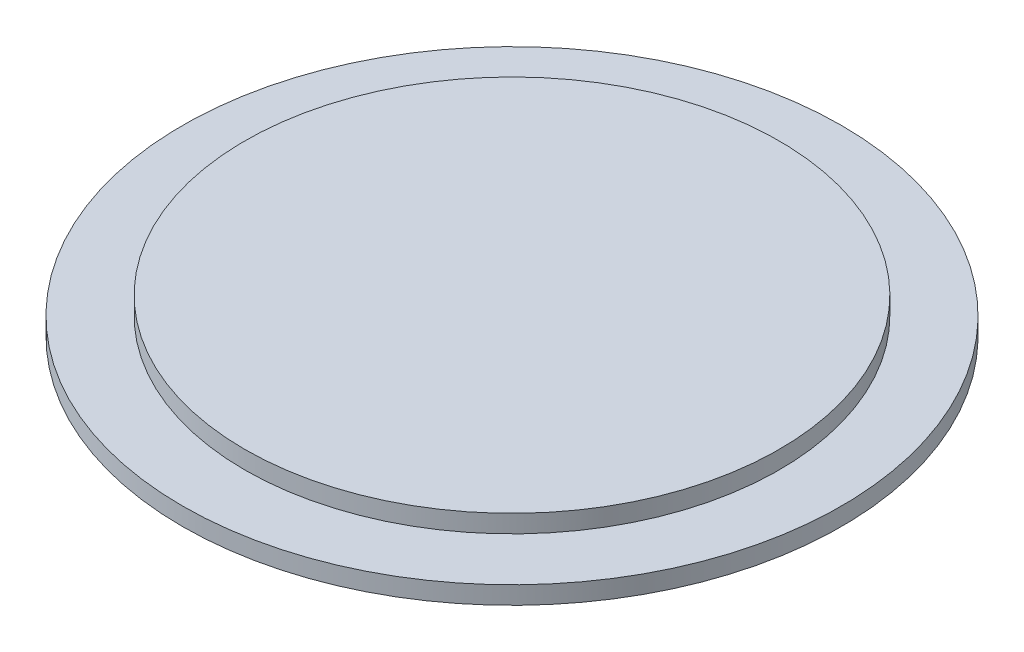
ISO-10303-21;
HEADER;
FILE_DESCRIPTION(('STEP AP214'),'2;1');
FILE_NAME('part.step','',(''),(''),'','','');
FILE_SCHEMA(('AUTOMOTIVE_DESIGN { 1 0 10303 214 1 1 1 1 }'));
ENDSEC;
DATA;
#1=APPLICATION_CONTEXT('core data for automotive mechanical design processes');
#2=APPLICATION_PROTOCOL_DEFINITION('international standard','automotive_design',2000,#1);
#3=PRODUCT_CONTEXT('',#1,'mechanical');
#4=PRODUCT('Part','Part','',(#3));
#5=PRODUCT_RELATED_PRODUCT_CATEGORY('part','',(#4));
#6=PRODUCT_DEFINITION_FORMATION('','',#4);
#7=PRODUCT_DEFINITION_CONTEXT('part definition',#1,'design');
#8=PRODUCT_DEFINITION('design','',#6,#7);
#9=PRODUCT_DEFINITION_SHAPE('','',#8);
#10=(LENGTH_UNIT() NAMED_UNIT(*) SI_UNIT(.MILLI.,.METRE.));
#11=(NAMED_UNIT(*) PLANE_ANGLE_UNIT() SI_UNIT($,.RADIAN.));
#12=(NAMED_UNIT(*) SI_UNIT($,.STERADIAN.) SOLID_ANGLE_UNIT());
#13=UNCERTAINTY_MEASURE_WITH_UNIT(LENGTH_MEASURE(1.E-05),#10,'distance_accuracy_value','');
#14=(GEOMETRIC_REPRESENTATION_CONTEXT(3) GLOBAL_UNCERTAINTY_ASSIGNED_CONTEXT((#13)) GLOBAL_UNIT_ASSIGNED_CONTEXT((#10,
#11,#12)) REPRESENTATION_CONTEXT('',''));
#15=CARTESIAN_POINT('',(0.,0.,0.));
#16=DIRECTION('',(0.,0.,1.));
#17=DIRECTION('',(1.,0.,0.));
#18=AXIS2_PLACEMENT_3D('',#15,#16,#17);
#19=CARTESIAN_POINT('',(0.,0.,0.));
#20=DIRECTION('',(0.,1.,0.));
#21=DIRECTION('',(0.,0.,1.));
#22=AXIS2_PLACEMENT_3D('',#19,#20,#21);
#23=PLANE('',#22);
#24=CARTESIAN_POINT('',(0.,0.,0.));
#25=DIRECTION('',(0.,1.,0.));
#26=DIRECTION('',(0.,0.,1.));
#27=AXIS2_PLACEMENT_3D('',#24,#25,#26);
#28=CIRCLE('',#27,18.5);
#29=CARTESIAN_POINT('',(0.,0.,18.5));
#30=VERTEX_POINT('',#29);
#31=EDGE_CURVE('E10',#30,#30,#28,.T.);
#32=ORIENTED_EDGE('',*,*,#31,.F.);
#33=EDGE_LOOP('',(#32));
#34=FACE_BOUND('',#33,.T.);
#35=ADVANCED_FACE('F27',(#34),#23,.F.);
#36=CARTESIAN_POINT('',(0.,18.7921319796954,0.));
#37=DIRECTION('',(0.,1.,0.));
#38=DIRECTION('',(0.,0.,1.));
#39=AXIS2_PLACEMENT_3D('',#36,#37,#38);
#40=CYLINDRICAL_SURFACE('',#39,18.5);
#41=CARTESIAN_POINT('',(0.,0.999999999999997,0.));
#42=DIRECTION('',(0.,1.,0.));
#43=DIRECTION('',(0.,0.,1.));
#44=AXIS2_PLACEMENT_3D('',#41,#42,#43);
#45=CIRCLE('',#44,18.5);
#46=CARTESIAN_POINT('',(0.,0.999999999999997,18.5));
#47=VERTEX_POINT('',#46);
#48=EDGE_CURVE('E33',#47,#47,#45,.T.);
#49=ORIENTED_EDGE('',*,*,#48,.F.);
#50=EDGE_LOOP('',(#49));
#51=FACE_BOUND('',#50,.T.);
#52=ORIENTED_EDGE('',*,*,#31,.T.);
#53=EDGE_LOOP('',(#52));
#54=FACE_BOUND('',#53,.T.);
#55=ADVANCED_FACE('F57',(#51,#54),#40,.T.);
#56=CARTESIAN_POINT('',(18.5,0.999999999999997,0.));
#57=DIRECTION('',(0.,-1.,0.));
#58=DIRECTION('',(0.,0.,-1.));
#59=AXIS2_PLACEMENT_3D('',#56,#57,#58);
#60=PLANE('',#59);
#61=CARTESIAN_POINT('',(0.,0.999999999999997,0.));
#62=DIRECTION('',(0.,1.,0.));
#63=DIRECTION('',(0.,0.,1.));
#64=AXIS2_PLACEMENT_3D('',#61,#62,#63);
#65=CIRCLE('',#64,15.);
#66=CARTESIAN_POINT('',(0.,0.999999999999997,15.));
#67=VERTEX_POINT('',#66);
#68=EDGE_CURVE('E37',#67,#67,#65,.T.);
#69=ORIENTED_EDGE('',*,*,#68,.F.);
#70=EDGE_LOOP('',(#69));
#71=FACE_BOUND('',#70,.T.);
#72=ORIENTED_EDGE('',*,*,#48,.T.);
#73=EDGE_LOOP('',(#72));
#74=FACE_BOUND('',#73,.T.);
#75=ADVANCED_FACE('F52',(#71,#74),#60,.F.);
#76=CARTESIAN_POINT('',(0.,18.7921319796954,0.));
#77=DIRECTION('',(0.,1.,0.));
#78=DIRECTION('',(0.,0.,1.));
#79=AXIS2_PLACEMENT_3D('',#76,#77,#78);
#80=CYLINDRICAL_SURFACE('',#79,15.);
#81=CARTESIAN_POINT('',(0.,2.,0.));
#82=DIRECTION('',(0.,1.,0.));
#83=DIRECTION('',(0.,0.,1.));
#84=AXIS2_PLACEMENT_3D('',#81,#82,#83);
#85=CIRCLE('',#84,15.);
#86=CARTESIAN_POINT('',(0.,2.,15.));
#87=VERTEX_POINT('',#86);
#88=EDGE_CURVE('E41',#87,#87,#85,.T.);
#89=ORIENTED_EDGE('',*,*,#88,.F.);
#90=EDGE_LOOP('',(#89));
#91=FACE_BOUND('',#90,.T.);
#92=ORIENTED_EDGE('',*,*,#68,.T.);
#93=EDGE_LOOP('',(#92));
#94=FACE_BOUND('',#93,.T.);
#95=ADVANCED_FACE('F49',(#91,#94),#80,.T.);
#96=CARTESIAN_POINT('',(15.,2.,0.));
#97=DIRECTION('',(0.,-1.,0.));
#98=DIRECTION('',(0.,0.,-1.));
#99=AXIS2_PLACEMENT_3D('',#96,#97,#98);
#100=PLANE('',#99);
#101=ORIENTED_EDGE('',*,*,#88,.T.);
#102=EDGE_LOOP('',(#101));
#103=FACE_BOUND('',#102,.T.);
#104=ADVANCED_FACE('F47',(#103),#100,.F.);
#105=CLOSED_SHELL('',(#35,#55,#75,#95,#104));
#106=MANIFOLD_SOLID_BREP('B2',#105);
#107=ADVANCED_BREP_SHAPE_REPRESENTATION('',(#18,#106),#14);
#108=SHAPE_DEFINITION_REPRESENTATION(#9,#107);
ENDSEC;
END-ISO-10303-21;
